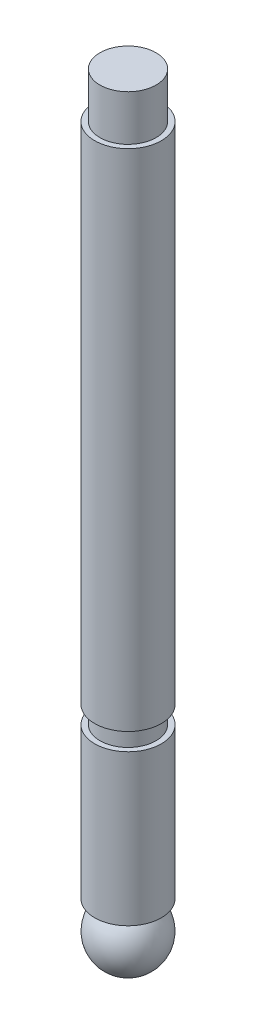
ISO-10303-21;
HEADER;
FILE_DESCRIPTION(('STEP AP214'),'2;1');
FILE_NAME('part.step','',(''),(''),'','','');
FILE_SCHEMA(('AUTOMOTIVE_DESIGN { 1 0 10303 214 1 1 1 1 }'));
ENDSEC;
DATA;
#1=APPLICATION_CONTEXT('core data for automotive mechanical design processes');
#2=APPLICATION_PROTOCOL_DEFINITION('international standard','automotive_design',2000,#1);
#3=PRODUCT_CONTEXT('',#1,'mechanical');
#4=PRODUCT('Part','Part','',(#3));
#5=PRODUCT_RELATED_PRODUCT_CATEGORY('part','',(#4));
#6=PRODUCT_DEFINITION_FORMATION('','',#4);
#7=PRODUCT_DEFINITION_CONTEXT('part definition',#1,'design');
#8=PRODUCT_DEFINITION('design','',#6,#7);
#9=PRODUCT_DEFINITION_SHAPE('','',#8);
#10=(LENGTH_UNIT() NAMED_UNIT(*) SI_UNIT(.MILLI.,.METRE.));
#11=(NAMED_UNIT(*) PLANE_ANGLE_UNIT() SI_UNIT($,.RADIAN.));
#12=(NAMED_UNIT(*) SI_UNIT($,.STERADIAN.) SOLID_ANGLE_UNIT());
#13=UNCERTAINTY_MEASURE_WITH_UNIT(LENGTH_MEASURE(1.E-05),#10,'distance_accuracy_value','');
#14=(GEOMETRIC_REPRESENTATION_CONTEXT(3) GLOBAL_UNCERTAINTY_ASSIGNED_CONTEXT((#13)) GLOBAL_UNIT_ASSIGNED_CONTEXT((#10,
#11,#12)) REPRESENTATION_CONTEXT('',''));
#15=CARTESIAN_POINT('',(0.,0.,0.));
#16=DIRECTION('',(0.,0.,1.));
#17=DIRECTION('',(1.,0.,0.));
#18=AXIS2_PLACEMENT_3D('',#15,#16,#17);
#19=CARTESIAN_POINT('',(0.,-8.,0.));
#20=DIRECTION('',(0.,-1.,0.));
#21=DIRECTION('',(-1.,0.,0.));
#22=AXIS2_PLACEMENT_3D('',#19,#20,#21);
#23=SPHERICAL_SURFACE('',#22,9.5);
#24=CARTESIAN_POINT('',(0.,0.,0.));
#25=DIRECTION('',(0.,-1.,0.));
#26=DIRECTION('',(0.,0.,-1.));
#27=AXIS2_PLACEMENT_3D('',#24,#25,#26);
#28=CIRCLE('',#27,5.1234753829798);
#29=CARTESIAN_POINT('',(0.,0.,-5.1234753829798));
#30=VERTEX_POINT('',#29);
#31=EDGE_CURVE('E80',#30,#30,#28,.T.);
#32=ORIENTED_EDGE('',*,*,#31,.T.);
#33=EDGE_LOOP('',(#32));
#34=FACE_BOUND('',#33,.T.);
#35=ADVANCED_FACE('F39',(#34),#23,.T.);
#36=CARTESIAN_POINT('',(8.,205.,0.));
#37=DIRECTION('',(0.,1.,0.));
#38=DIRECTION('',(0.,0.,1.));
#39=AXIS2_PLACEMENT_3D('',#36,#37,#38);
#40=PLANE('',#39);
#41=CARTESIAN_POINT('',(0.,205.,0.));
#42=DIRECTION('',(0.,-1.,0.));
#43=DIRECTION('',(0.,0.,-1.));
#44=AXIS2_PLACEMENT_3D('',#41,#42,#43);
#45=CIRCLE('',#44,8.);
#46=CARTESIAN_POINT('',(0.,205.,-8.));
#47=VERTEX_POINT('',#46);
#48=EDGE_CURVE('E10',#47,#47,#45,.T.);
#49=ORIENTED_EDGE('',*,*,#48,.F.);
#50=EDGE_LOOP('',(#49));
#51=FACE_BOUND('',#50,.T.);
#52=ADVANCED_FACE('F99',(#51),#40,.T.);
#53=CARTESIAN_POINT('',(0.,0.,0.));
#54=DIRECTION('',(0.,-1.,0.));
#55=DIRECTION('',(0.,0.,-1.));
#56=AXIS2_PLACEMENT_3D('',#53,#54,#55);
#57=CYLINDRICAL_SURFACE('',#56,8.);
#58=ORIENTED_EDGE('',*,*,#48,.T.);
#59=EDGE_LOOP('',(#58));
#60=FACE_BOUND('',#59,.T.);
#61=CARTESIAN_POINT('',(0.,192.,0.));
#62=DIRECTION('',(0.,-1.,0.));
#63=DIRECTION('',(0.,0.,-1.));
#64=AXIS2_PLACEMENT_3D('',#61,#62,#63);
#65=CIRCLE('',#64,8.);
#66=CARTESIAN_POINT('',(0.,192.,-8.));
#67=VERTEX_POINT('',#66);
#68=EDGE_CURVE('E46',#67,#67,#65,.T.);
#69=ORIENTED_EDGE('',*,*,#68,.F.);
#70=EDGE_LOOP('',(#69));
#71=FACE_BOUND('',#70,.T.);
#72=ADVANCED_FACE('F103',(#60,#71),#57,.T.);
#73=CARTESIAN_POINT('',(9.5,192.,0.));
#74=DIRECTION('',(0.,1.,0.));
#75=DIRECTION('',(0.,0.,1.));
#76=AXIS2_PLACEMENT_3D('',#73,#74,#75);
#77=PLANE('',#76);
#78=ORIENTED_EDGE('',*,*,#68,.T.);
#79=EDGE_LOOP('',(#78));
#80=FACE_BOUND('',#79,.T.);
#81=CARTESIAN_POINT('',(0.,192.,0.));
#82=DIRECTION('',(0.,-1.,0.));
#83=DIRECTION('',(0.,0.,-1.));
#84=AXIS2_PLACEMENT_3D('',#81,#82,#83);
#85=CIRCLE('',#84,9.5);
#86=CARTESIAN_POINT('',(0.,192.,-9.5));
#87=VERTEX_POINT('',#86);
#88=EDGE_CURVE('E52',#87,#87,#85,.T.);
#89=ORIENTED_EDGE('',*,*,#88,.F.);
#90=EDGE_LOOP('',(#89));
#91=FACE_BOUND('',#90,.T.);
#92=ADVANCED_FACE('F108',(#80,#91),#77,.T.);
#93=CARTESIAN_POINT('',(0.,0.,0.));
#94=DIRECTION('',(0.,-1.,0.));
#95=DIRECTION('',(0.,0.,-1.));
#96=AXIS2_PLACEMENT_3D('',#93,#94,#95);
#97=CYLINDRICAL_SURFACE('',#96,9.5);
#98=ORIENTED_EDGE('',*,*,#88,.T.);
#99=EDGE_LOOP('',(#98));
#100=FACE_BOUND('',#99,.T.);
#101=CARTESIAN_POINT('',(0.,48.,0.));
#102=DIRECTION('',(0.,-1.,0.));
#103=DIRECTION('',(0.,0.,-1.));
#104=AXIS2_PLACEMENT_3D('',#101,#102,#103);
#105=CIRCLE('',#104,9.5);
#106=CARTESIAN_POINT('',(0.,48.,-9.5));
#107=VERTEX_POINT('',#106);
#108=EDGE_CURVE('E58',#107,#107,#105,.T.);
#109=ORIENTED_EDGE('',*,*,#108,.F.);
#110=EDGE_LOOP('',(#109));
#111=FACE_BOUND('',#110,.T.);
#112=ADVANCED_FACE('F113',(#100,#111),#97,.T.);
#113=CARTESIAN_POINT('',(8.,48.,0.));
#114=DIRECTION('',(0.,-1.,0.));
#115=DIRECTION('',(0.,0.,-1.));
#116=AXIS2_PLACEMENT_3D('',#113,#114,#115);
#117=PLANE('',#116);
#118=ORIENTED_EDGE('',*,*,#108,.T.);
#119=EDGE_LOOP('',(#118));
#120=FACE_BOUND('',#119,.T.);
#121=CARTESIAN_POINT('',(0.,48.,0.));
#122=DIRECTION('',(0.,-1.,0.));
#123=DIRECTION('',(0.,0.,-1.));
#124=AXIS2_PLACEMENT_3D('',#121,#122,#123);
#125=CIRCLE('',#124,8.);
#126=CARTESIAN_POINT('',(0.,48.,-8.));
#127=VERTEX_POINT('',#126);
#128=EDGE_CURVE('E64',#127,#127,#125,.T.);
#129=ORIENTED_EDGE('',*,*,#128,.F.);
#130=EDGE_LOOP('',(#129));
#131=FACE_BOUND('',#130,.T.);
#132=ADVANCED_FACE('F116',(#120,#131),#117,.T.);
#133=CARTESIAN_POINT('',(0.,0.,0.));
#134=DIRECTION('',(0.,-1.,0.));
#135=DIRECTION('',(0.,0.,-1.));
#136=AXIS2_PLACEMENT_3D('',#133,#134,#135);
#137=CYLINDRICAL_SURFACE('',#136,8.);
#138=ORIENTED_EDGE('',*,*,#128,.T.);
#139=EDGE_LOOP('',(#138));
#140=FACE_BOUND('',#139,.T.);
#141=CARTESIAN_POINT('',(0.,43.,0.));
#142=DIRECTION('',(0.,-1.,0.));
#143=DIRECTION('',(0.,0.,-1.));
#144=AXIS2_PLACEMENT_3D('',#141,#142,#143);
#145=CIRCLE('',#144,8.);
#146=CARTESIAN_POINT('',(0.,43.,-8.));
#147=VERTEX_POINT('',#146);
#148=EDGE_CURVE('E68',#147,#147,#145,.T.);
#149=ORIENTED_EDGE('',*,*,#148,.F.);
#150=EDGE_LOOP('',(#149));
#151=FACE_BOUND('',#150,.T.);
#152=ADVANCED_FACE('F120',(#140,#151),#137,.T.);
#153=CARTESIAN_POINT('',(9.5,43.,0.));
#154=DIRECTION('',(0.,1.,0.));
#155=DIRECTION('',(0.,0.,1.));
#156=AXIS2_PLACEMENT_3D('',#153,#154,#155);
#157=PLANE('',#156);
#158=ORIENTED_EDGE('',*,*,#148,.T.);
#159=EDGE_LOOP('',(#158));
#160=FACE_BOUND('',#159,.T.);
#161=CARTESIAN_POINT('',(0.,43.,0.));
#162=DIRECTION('',(0.,-1.,0.));
#163=DIRECTION('',(0.,0.,-1.));
#164=AXIS2_PLACEMENT_3D('',#161,#162,#163);
#165=CIRCLE('',#164,9.5);
#166=CARTESIAN_POINT('',(0.,43.,-9.5));
#167=VERTEX_POINT('',#166);
#168=EDGE_CURVE('E72',#167,#167,#165,.T.);
#169=ORIENTED_EDGE('',*,*,#168,.F.);
#170=EDGE_LOOP('',(#169));
#171=FACE_BOUND('',#170,.T.);
#172=ADVANCED_FACE('F95',(#160,#171),#157,.T.);
#173=CARTESIAN_POINT('',(0.,0.,0.));
#174=DIRECTION('',(0.,-1.,0.));
#175=DIRECTION('',(0.,0.,-1.));
#176=AXIS2_PLACEMENT_3D('',#173,#174,#175);
#177=CYLINDRICAL_SURFACE('',#176,9.5);
#178=ORIENTED_EDGE('',*,*,#168,.T.);
#179=EDGE_LOOP('',(#178));
#180=FACE_BOUND('',#179,.T.);
#181=CARTESIAN_POINT('',(0.,0.,0.));
#182=DIRECTION('',(0.,-1.,0.));
#183=DIRECTION('',(0.,0.,-1.));
#184=AXIS2_PLACEMENT_3D('',#181,#182,#183);
#185=CIRCLE('',#184,9.5);
#186=CARTESIAN_POINT('',(0.,0.,-9.5));
#187=VERTEX_POINT('',#186);
#188=EDGE_CURVE('E76',#187,#187,#185,.T.);
#189=ORIENTED_EDGE('',*,*,#188,.F.);
#190=EDGE_LOOP('',(#189));
#191=FACE_BOUND('',#190,.T.);
#192=ADVANCED_FACE('F89',(#180,#191),#177,.T.);
#193=CARTESIAN_POINT('',(9.5,0.,0.));
#194=DIRECTION('',(0.,-1.,0.));
#195=DIRECTION('',(0.,0.,-1.));
#196=AXIS2_PLACEMENT_3D('',#193,#194,#195);
#197=PLANE('',#196);
#198=ORIENTED_EDGE('',*,*,#188,.T.);
#199=EDGE_LOOP('',(#198));
#200=FACE_BOUND('',#199,.T.);
#201=ORIENTED_EDGE('',*,*,#31,.F.);
#202=EDGE_LOOP('',(#201));
#203=FACE_BOUND('',#202,.T.);
#204=ADVANCED_FACE('F87',(#200,#203),#197,.T.);
#205=CLOSED_SHELL('',(#35,#52,#72,#92,#112,#132,#152,#172,#192,#204));
#206=MANIFOLD_SOLID_BREP('B2',#205);
#207=ADVANCED_BREP_SHAPE_REPRESENTATION('',(#18,#206),#14);
#208=SHAPE_DEFINITION_REPRESENTATION(#9,#207);
ENDSEC;
END-ISO-10303-21;
